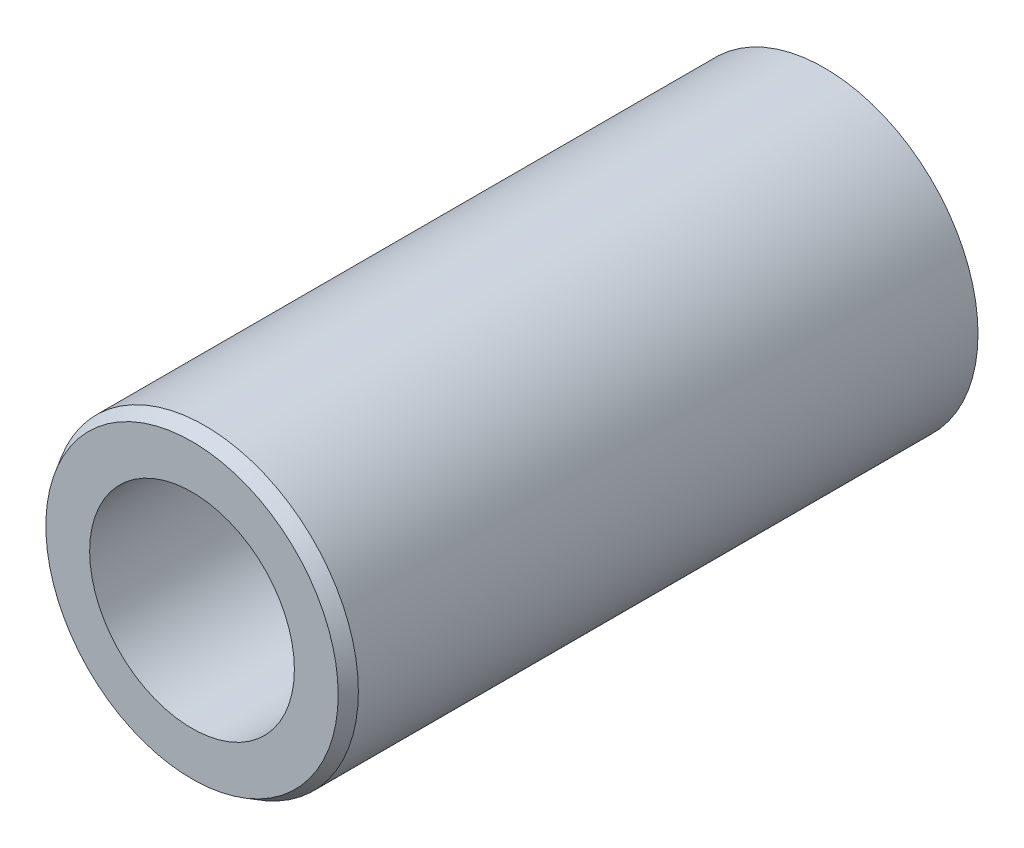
from build123d import *
from OCP.BRepFilletAPI import BRepFilletAPI_MakeChamfer

# Parameters (mm, degrees)
ESQUISSE1_R        = 6
ESQUISSE1_R_2      = 4
BOSS_EXTRU_1_DEPTH = 12.5
CHANFREIN1_SIZE    = 0.5
CHANFREIN1_SIZE2   = 0.288675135


with BuildPart() as part:
    # Esquisse1 → Boss.-Extru.1 (new, symmetric)
    with BuildSketch(Plane.XY):
        Circle(ESQUISSE1_R)
        Circle(ESQUISSE1_R_2, mode=Mode.SUBTRACT)
    extrude(amount=BOSS_EXTRU_1_DEPTH, both=True)

    # Chanfrein1: one chamfer whose edges measure the first distance from different faces: ONE call of the kernel's chamfer builder (chamfer() names one face for all edges)
    chanfrein1_edges_1 = [part.edges().sort_by_distance(p)[0] for p in [
        (-6, 0, -12.5),
    ]]
    chanfrein1_side_1 = [part.faces().sort_by_distance(p)[0] for p in [
        (-5.830294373, 0, -12.5),
    ]]
    chanfrein1_edges_2 = [part.edges().sort_by_distance(p)[0] for p in [
        (-6, 0, 12.5),
    ]]
    chanfrein1_side_2 = [part.faces().sort_by_distance(p)[0] for p in [
        (-6, 0, 0),
    ]]
    chanfrein1 = BRepFilletAPI_MakeChamfer(part.part.solid().wrapped)
    for e in chanfrein1_edges_1:
        chanfrein1.Add(CHANFREIN1_SIZE, CHANFREIN1_SIZE2, e.wrapped, chanfrein1_side_1[0].wrapped)  # the first distance lies on this face
    for e in chanfrein1_edges_2:
        chanfrein1.Add(CHANFREIN1_SIZE, CHANFREIN1_SIZE2, e.wrapped, chanfrein1_side_2[0].wrapped)  # the first distance lies on this face
    add(Compound.cast(chanfrein1.Shape()), mode=Mode.REPLACE)


solid = part.part
